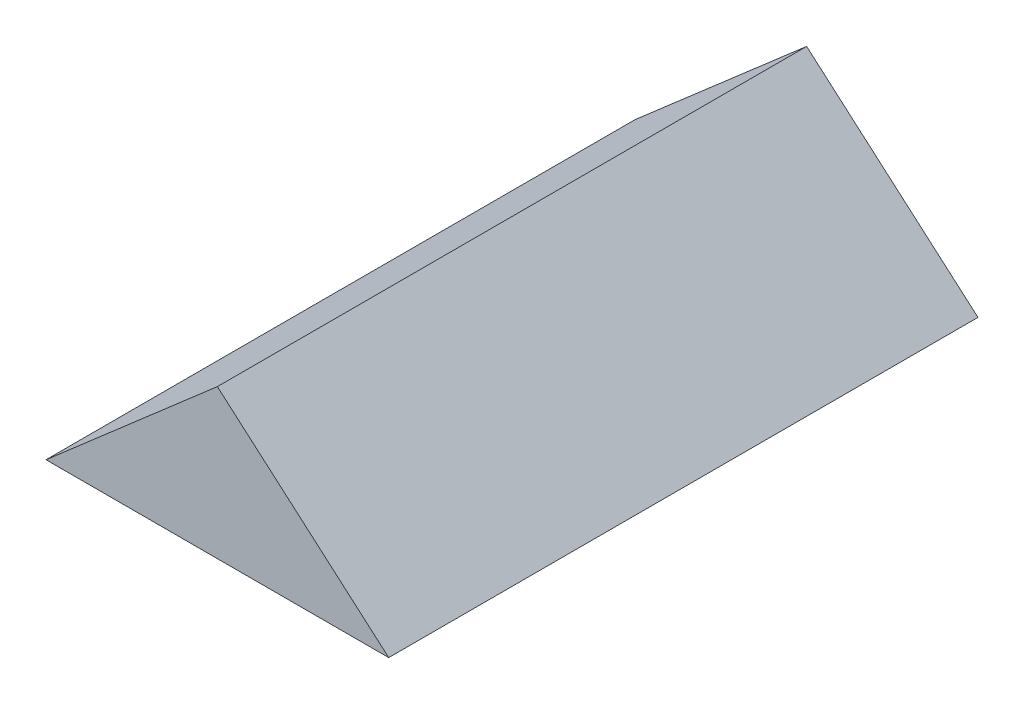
ISO-10303-21;
HEADER;
FILE_DESCRIPTION(('STEP AP214'),'2;1');
FILE_NAME('part.step','',(''),(''),'','','');
FILE_SCHEMA(('AUTOMOTIVE_DESIGN { 1 0 10303 214 1 1 1 1 }'));
ENDSEC;
DATA;
#1=APPLICATION_CONTEXT('core data for automotive mechanical design processes');
#2=APPLICATION_PROTOCOL_DEFINITION('international standard','automotive_design',2000,#1);
#3=PRODUCT_CONTEXT('',#1,'mechanical');
#4=PRODUCT('Part','Part','',(#3));
#5=PRODUCT_RELATED_PRODUCT_CATEGORY('part','',(#4));
#6=PRODUCT_DEFINITION_FORMATION('','',#4);
#7=PRODUCT_DEFINITION_CONTEXT('part definition',#1,'design');
#8=PRODUCT_DEFINITION('design','',#6,#7);
#9=PRODUCT_DEFINITION_SHAPE('','',#8);
#10=(LENGTH_UNIT() NAMED_UNIT(*) SI_UNIT(.MILLI.,.METRE.));
#11=(NAMED_UNIT(*) PLANE_ANGLE_UNIT() SI_UNIT($,.RADIAN.));
#12=(NAMED_UNIT(*) SI_UNIT($,.STERADIAN.) SOLID_ANGLE_UNIT());
#13=UNCERTAINTY_MEASURE_WITH_UNIT(LENGTH_MEASURE(1.E-05),#10,'distance_accuracy_value','');
#14=(GEOMETRIC_REPRESENTATION_CONTEXT(3) GLOBAL_UNCERTAINTY_ASSIGNED_CONTEXT((#13)) GLOBAL_UNIT_ASSIGNED_CONTEXT((#10,
#11,#12)) REPRESENTATION_CONTEXT('',''));
#15=CARTESIAN_POINT('',(0.,0.,0.));
#16=DIRECTION('',(0.,0.,1.));
#17=DIRECTION('',(1.,0.,0.));
#18=AXIS2_PLACEMENT_3D('',#15,#16,#17);
#19=CARTESIAN_POINT('',(0.,0.,87.));
#20=DIRECTION('',(0.656178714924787,-0.754605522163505,0.));
#21=DIRECTION('',(0.754605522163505,0.656178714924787,0.));
#22=AXIS2_PLACEMENT_3D('',#19,#20,#21);
#23=PLANE('',#22);
#24=DIRECTION('',(-0.754605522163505,-0.656178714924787,0.));
#25=VECTOR('',#24,1.);
#26=CARTESIAN_POINT('',(0.,0.,0.));
#27=LINE('',#26,#25);
#28=CARTESIAN_POINT('',(25.3,22.,0.));
#29=VERTEX_POINT('',#28);
#30=CARTESIAN_POINT('',(0.,0.,0.));
#31=VERTEX_POINT('',#30);
#32=EDGE_CURVE('E78',#29,#31,#27,.T.);
#33=ORIENTED_EDGE('',*,*,#32,.T.);
#34=DIRECTION('',(0.,0.,-1.));
#35=VECTOR('',#34,1.);
#36=CARTESIAN_POINT('',(0.,0.,87.));
#37=LINE('',#36,#35);
#38=CARTESIAN_POINT('',(0.,0.,87.));
#39=VERTEX_POINT('',#38);
#40=EDGE_CURVE('E11',#39,#31,#37,.T.);
#41=ORIENTED_EDGE('',*,*,#40,.F.);
#42=DIRECTION('',(-0.754605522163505,-0.656178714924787,0.));
#43=VECTOR('',#42,1.);
#44=CARTESIAN_POINT('',(0.,0.,87.));
#45=LINE('',#44,#43);
#46=CARTESIAN_POINT('',(25.3,22.,87.));
#47=VERTEX_POINT('',#46);
#48=EDGE_CURVE('E71',#47,#39,#45,.T.);
#49=ORIENTED_EDGE('',*,*,#48,.F.);
#50=DIRECTION('',(0.,0.,-1.));
#51=VECTOR('',#50,1.);
#52=CARTESIAN_POINT('',(25.3,22.,87.));
#53=LINE('',#52,#51);
#54=EDGE_CURVE('E79',#47,#29,#53,.T.);
#55=ORIENTED_EDGE('',*,*,#54,.T.);
#56=EDGE_LOOP('',(#33,#41,#49,#55));
#57=FACE_BOUND('',#56,.T.);
#58=ADVANCED_FACE('F31',(#57),#23,.F.);
#59=CARTESIAN_POINT('',(0.,0.,87.));
#60=DIRECTION('',(0.,1.,0.));
#61=DIRECTION('',(0.,0.,1.));
#62=AXIS2_PLACEMENT_3D('',#59,#60,#61);
#63=PLANE('',#62);
#64=DIRECTION('',(1.,0.,0.));
#65=VECTOR('',#64,1.);
#66=CARTESIAN_POINT('',(0.,0.,0.));
#67=LINE('',#66,#65);
#68=CARTESIAN_POINT('',(50.6,0.,0.));
#69=VERTEX_POINT('',#68);
#70=EDGE_CURVE('E59',#31,#69,#67,.T.);
#71=ORIENTED_EDGE('',*,*,#70,.T.);
#72=DIRECTION('',(0.,0.,-1.));
#73=VECTOR('',#72,1.);
#74=CARTESIAN_POINT('',(50.6,0.,87.));
#75=LINE('',#74,#73);
#76=CARTESIAN_POINT('',(50.6,0.,87.));
#77=VERTEX_POINT('',#76);
#78=EDGE_CURVE('E39',#77,#69,#75,.T.);
#79=ORIENTED_EDGE('',*,*,#78,.F.);
#80=DIRECTION('',(1.,0.,0.));
#81=VECTOR('',#80,1.);
#82=CARTESIAN_POINT('',(0.,0.,87.));
#83=LINE('',#82,#81);
#84=EDGE_CURVE('E67',#39,#77,#83,.T.);
#85=ORIENTED_EDGE('',*,*,#84,.F.);
#86=ORIENTED_EDGE('',*,*,#40,.T.);
#87=EDGE_LOOP('',(#71,#79,#85,#86));
#88=FACE_BOUND('',#87,.T.);
#89=ADVANCED_FACE('F68',(#88),#63,.F.);
#90=CARTESIAN_POINT('',(25.3,22.,87.));
#91=DIRECTION('',(-0.656178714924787,-0.754605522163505,0.));
#92=DIRECTION('',(0.754605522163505,-0.656178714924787,0.));
#93=AXIS2_PLACEMENT_3D('',#90,#91,#92);
#94=PLANE('',#93);
#95=DIRECTION('',(-0.754605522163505,0.656178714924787,0.));
#96=VECTOR('',#95,1.);
#97=CARTESIAN_POINT('',(25.3,22.,0.));
#98=LINE('',#97,#96);
#99=EDGE_CURVE('E64',#69,#29,#98,.T.);
#100=ORIENTED_EDGE('',*,*,#99,.T.);
#101=ORIENTED_EDGE('',*,*,#54,.F.);
#102=DIRECTION('',(-0.754605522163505,0.656178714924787,0.));
#103=VECTOR('',#102,1.);
#104=CARTESIAN_POINT('',(25.3,22.,87.));
#105=LINE('',#104,#103);
#106=EDGE_CURVE('E47',#77,#47,#105,.T.);
#107=ORIENTED_EDGE('',*,*,#106,.F.);
#108=ORIENTED_EDGE('',*,*,#78,.T.);
#109=EDGE_LOOP('',(#100,#101,#107,#108));
#110=FACE_BOUND('',#109,.T.);
#111=ADVANCED_FACE('F86',(#110),#94,.F.);
#112=CARTESIAN_POINT('',(25.3,22.,87.));
#113=DIRECTION('',(0.,0.,-1.));
#114=DIRECTION('',(-1.,0.,0.));
#115=AXIS2_PLACEMENT_3D('',#112,#113,#114);
#116=PLANE('',#115);
#117=ORIENTED_EDGE('',*,*,#48,.T.);
#118=ORIENTED_EDGE('',*,*,#84,.T.);
#119=ORIENTED_EDGE('',*,*,#106,.T.);
#120=EDGE_LOOP('',(#117,#118,#119));
#121=FACE_BOUND('',#120,.T.);
#122=ADVANCED_FACE('F74',(#121),#116,.F.);
#123=CARTESIAN_POINT('',(25.3,22.,0.));
#124=DIRECTION('',(0.,0.,-1.));
#125=DIRECTION('',(-1.,0.,0.));
#126=AXIS2_PLACEMENT_3D('',#123,#124,#125);
#127=PLANE('',#126);
#128=ORIENTED_EDGE('',*,*,#32,.F.);
#129=ORIENTED_EDGE('',*,*,#99,.F.);
#130=ORIENTED_EDGE('',*,*,#70,.F.);
#131=EDGE_LOOP('',(#128,#129,#130));
#132=FACE_BOUND('',#131,.T.);
#133=ADVANCED_FACE('F87',(#132),#127,.T.);
#134=CLOSED_SHELL('',(#58,#89,#111,#122,#133));
#135=MANIFOLD_SOLID_BREP('B2',#134);
#136=ADVANCED_BREP_SHAPE_REPRESENTATION('',(#18,#135),#14);
#137=SHAPE_DEFINITION_REPRESENTATION(#9,#136);
ENDSEC;
END-ISO-10303-21;
